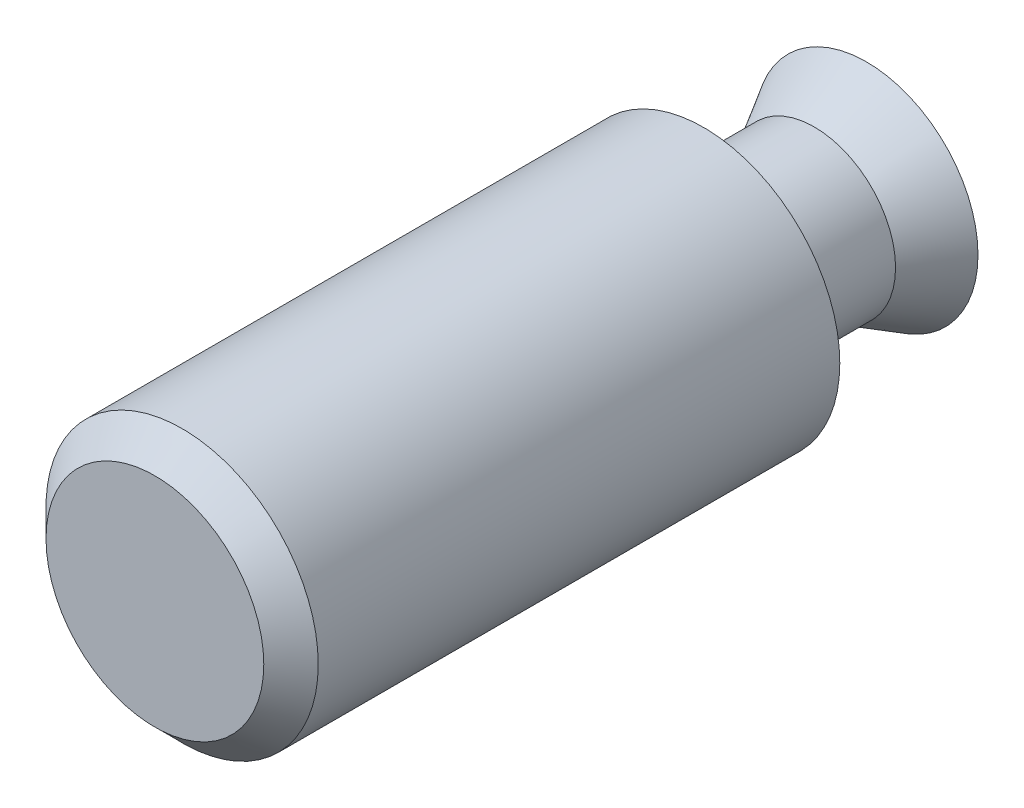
ISO-10303-21;
HEADER;
FILE_DESCRIPTION(('STEP AP214'),'2;1');
FILE_NAME('part.step','',(''),(''),'','','');
FILE_SCHEMA(('AUTOMOTIVE_DESIGN { 1 0 10303 214 1 1 1 1 }'));
ENDSEC;
DATA;
#1=APPLICATION_CONTEXT('core data for automotive mechanical design processes');
#2=APPLICATION_PROTOCOL_DEFINITION('international standard','automotive_design',2000,#1);
#3=PRODUCT_CONTEXT('',#1,'mechanical');
#4=PRODUCT('Part','Part','',(#3));
#5=PRODUCT_RELATED_PRODUCT_CATEGORY('part','',(#4));
#6=PRODUCT_DEFINITION_FORMATION('','',#4);
#7=PRODUCT_DEFINITION_CONTEXT('part definition',#1,'design');
#8=PRODUCT_DEFINITION('design','',#6,#7);
#9=PRODUCT_DEFINITION_SHAPE('','',#8);
#10=(LENGTH_UNIT() NAMED_UNIT(*) SI_UNIT(.MILLI.,.METRE.));
#11=(NAMED_UNIT(*) PLANE_ANGLE_UNIT() SI_UNIT($,.RADIAN.));
#12=(NAMED_UNIT(*) SI_UNIT($,.STERADIAN.) SOLID_ANGLE_UNIT());
#13=UNCERTAINTY_MEASURE_WITH_UNIT(LENGTH_MEASURE(1.E-05),#10,'distance_accuracy_value','');
#14=(GEOMETRIC_REPRESENTATION_CONTEXT(3) GLOBAL_UNCERTAINTY_ASSIGNED_CONTEXT((#13)) GLOBAL_UNIT_ASSIGNED_CONTEXT((#10,
#11,#12)) REPRESENTATION_CONTEXT('',''));
#15=CARTESIAN_POINT('',(0.,0.,0.));
#16=DIRECTION('',(0.,0.,1.));
#17=DIRECTION('',(1.,0.,0.));
#18=AXIS2_PLACEMENT_3D('',#15,#16,#17);
#19=CARTESIAN_POINT('',(0.,0.,0.));
#20=DIRECTION('',(0.,0.,-1.));
#21=DIRECTION('',(-1.,0.,0.));
#22=AXIS2_PLACEMENT_3D('',#19,#20,#21);
#23=PLANE('',#22);
#24=CARTESIAN_POINT('',(0.,0.,0.));
#25=DIRECTION('',(0.,0.,1.));
#26=DIRECTION('',(1.,0.,0.));
#27=AXIS2_PLACEMENT_3D('',#24,#25,#26);
#28=CIRCLE('',#27,3.175);
#29=CARTESIAN_POINT('',(3.175,0.,0.));
#30=VERTEX_POINT('',#29);
#31=EDGE_CURVE('E10',#30,#30,#28,.T.);
#32=ORIENTED_EDGE('',*,*,#31,.T.);
#33=EDGE_LOOP('',(#32));
#34=FACE_BOUND('',#33,.T.);
#35=ADVANCED_FACE('F35',(#34),#23,.F.);
#36=CARTESIAN_POINT('',(0.,0.,-0.79375));
#37=DIRECTION('',(0.,0.,-1.));
#38=DIRECTION('',(-1.,0.,0.));
#39=AXIS2_PLACEMENT_3D('',#36,#37,#38);
#40=CONICAL_SURFACE('',#39,3.96875,0.785398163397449);
#41=ORIENTED_EDGE('',*,*,#31,.F.);
#42=EDGE_LOOP('',(#41));
#43=FACE_BOUND('',#42,.T.);
#44=CARTESIAN_POINT('',(0.,0.,-0.79375));
#45=DIRECTION('',(0.,0.,1.));
#46=DIRECTION('',(1.,0.,0.));
#47=AXIS2_PLACEMENT_3D('',#44,#45,#46);
#48=CIRCLE('',#47,3.96875);
#49=CARTESIAN_POINT('',(3.96875,0.,-0.79375));
#50=VERTEX_POINT('',#49);
#51=EDGE_CURVE('E41',#50,#50,#48,.T.);
#52=ORIENTED_EDGE('',*,*,#51,.T.);
#53=EDGE_LOOP('',(#52));
#54=FACE_BOUND('',#53,.T.);
#55=ADVANCED_FACE('F73',(#43,#54),#40,.T.);
#56=CARTESIAN_POINT('',(0.,0.,0.));
#57=DIRECTION('',(0.,0.,1.));
#58=DIRECTION('',(1.,0.,0.));
#59=AXIS2_PLACEMENT_3D('',#56,#57,#58);
#60=CYLINDRICAL_SURFACE('',#59,3.96875);
#61=ORIENTED_EDGE('',*,*,#51,.F.);
#62=EDGE_LOOP('',(#61));
#63=FACE_BOUND('',#62,.T.);
#64=CARTESIAN_POINT('',(0.,0.,-16.002));
#65=DIRECTION('',(0.,0.,1.));
#66=DIRECTION('',(1.,0.,0.));
#67=AXIS2_PLACEMENT_3D('',#64,#65,#66);
#68=CIRCLE('',#67,3.96875);
#69=CARTESIAN_POINT('',(3.96875,0.,-16.002));
#70=VERTEX_POINT('',#69);
#71=EDGE_CURVE('E45',#70,#70,#68,.T.);
#72=ORIENTED_EDGE('',*,*,#71,.T.);
#73=EDGE_LOOP('',(#72));
#74=FACE_BOUND('',#73,.T.);
#75=ADVANCED_FACE('F77',(#63,#74),#60,.T.);
#76=CARTESIAN_POINT('',(0.,3.96875,-16.002));
#77=DIRECTION('',(0.,0.,1.));
#78=DIRECTION('',(1.,0.,0.));
#79=AXIS2_PLACEMENT_3D('',#76,#77,#78);
#80=PLANE('',#79);
#81=ORIENTED_EDGE('',*,*,#71,.F.);
#82=EDGE_LOOP('',(#81));
#83=FACE_BOUND('',#82,.T.);
#84=CARTESIAN_POINT('',(0.,0.,-16.002));
#85=DIRECTION('',(0.,0.,1.));
#86=DIRECTION('',(1.,0.,0.));
#87=AXIS2_PLACEMENT_3D('',#84,#85,#86);
#88=CIRCLE('',#87,2.36855);
#89=CARTESIAN_POINT('',(2.36855,0.,-16.002));
#90=VERTEX_POINT('',#89);
#91=EDGE_CURVE('E49',#90,#90,#88,.T.);
#92=ORIENTED_EDGE('',*,*,#91,.T.);
#93=EDGE_LOOP('',(#92));
#94=FACE_BOUND('',#93,.T.);
#95=ADVANCED_FACE('F82',(#83,#94),#80,.F.);
#96=CARTESIAN_POINT('',(0.,0.,0.));
#97=DIRECTION('',(0.,0.,1.));
#98=DIRECTION('',(1.,0.,0.));
#99=AXIS2_PLACEMENT_3D('',#96,#97,#98);
#100=CYLINDRICAL_SURFACE('',#99,2.36855);
#101=ORIENTED_EDGE('',*,*,#91,.F.);
#102=EDGE_LOOP('',(#101));
#103=FACE_BOUND('',#102,.T.);
#104=CARTESIAN_POINT('',(0.,0.,-19.2278));
#105=DIRECTION('',(0.,0.,1.));
#106=DIRECTION('',(1.,0.,0.));
#107=AXIS2_PLACEMENT_3D('',#104,#105,#106);
#108=CIRCLE('',#107,2.36855);
#109=CARTESIAN_POINT('',(2.36855,0.,-19.2278));
#110=VERTEX_POINT('',#109);
#111=EDGE_CURVE('E54',#110,#110,#108,.T.);
#112=ORIENTED_EDGE('',*,*,#111,.T.);
#113=EDGE_LOOP('',(#112));
#114=FACE_BOUND('',#113,.T.);
#115=ADVANCED_FACE('F69',(#103,#114),#100,.T.);
#116=CARTESIAN_POINT('',(0.,0.,-20.7518));
#117=DIRECTION('',(0.,0.,-1.));
#118=DIRECTION('',(-1.,0.,0.));
#119=AXIS2_PLACEMENT_3D('',#116,#117,#118);
#120=CONICAL_SURFACE('',#119,3.24843181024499,0.523598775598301);
#121=ORIENTED_EDGE('',*,*,#111,.F.);
#122=EDGE_LOOP('',(#121));
#123=FACE_BOUND('',#122,.T.);
#124=CARTESIAN_POINT('',(0.,0.,-20.7518));
#125=DIRECTION('',(0.,0.,1.));
#126=DIRECTION('',(1.,0.,0.));
#127=AXIS2_PLACEMENT_3D('',#124,#125,#126);
#128=CIRCLE('',#127,3.24843181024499);
#129=CARTESIAN_POINT('',(3.24843181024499,0.,-20.7518));
#130=VERTEX_POINT('',#129);
#131=EDGE_CURVE('E57',#130,#130,#128,.T.);
#132=ORIENTED_EDGE('',*,*,#131,.T.);
#133=EDGE_LOOP('',(#132));
#134=FACE_BOUND('',#133,.T.);
#135=ADVANCED_FACE('F61',(#123,#134),#120,.T.);
#136=CARTESIAN_POINT('',(0.,3.24843181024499,-20.7518));
#137=DIRECTION('',(0.,0.,1.));
#138=DIRECTION('',(1.,0.,0.));
#139=AXIS2_PLACEMENT_3D('',#136,#137,#138);
#140=PLANE('',#139);
#141=ORIENTED_EDGE('',*,*,#131,.F.);
#142=EDGE_LOOP('',(#141));
#143=FACE_BOUND('',#142,.T.);
#144=ADVANCED_FACE('F63',(#143),#140,.F.);
#145=CLOSED_SHELL('',(#35,#55,#75,#95,#115,#135,#144));
#146=MANIFOLD_SOLID_BREP('B2',#145);
#147=ADVANCED_BREP_SHAPE_REPRESENTATION('',(#18,#146),#14);
#148=SHAPE_DEFINITION_REPRESENTATION(#9,#147);
ENDSEC;
END-ISO-10303-21;
